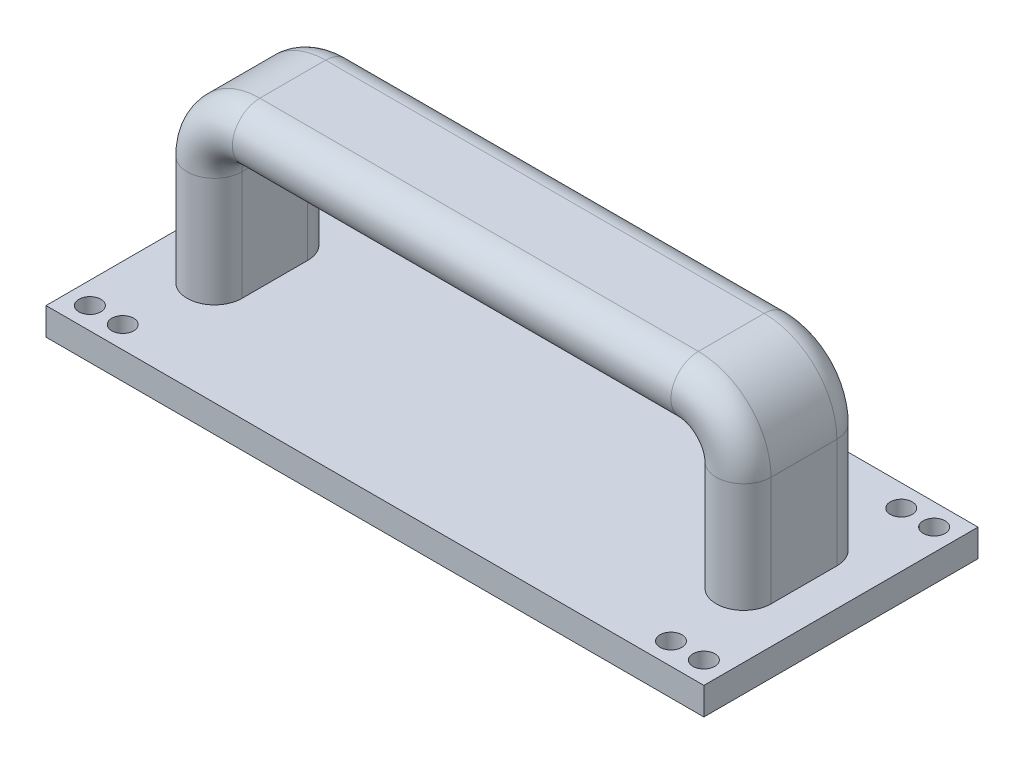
from build123d import *

# Parameters (mm, degrees)
SKETCH3_W           = 120
SKETCH3_H           = 50
BOSS_EXTRUDE1_DEPTH = 5
SKETCH6_R           = 2
CUT_EXTRUDE1_DEPTH  = 5


with BuildPart() as part:
    # Sketch3 → Boss-Extrude1 (new body)
    with BuildSketch(Plane(origin=(0, 0, 0), x_dir=(1, 0, 0), z_dir=(0, 1, 0))):
        Rectangle(SKETCH3_W, SKETCH3_H)
    extrude(amount=BOSS_EXTRUDE1_DEPTH)

    # Sweep1: sweep along a path in Sketch4
    with BuildLine(Plane.XY) as sweep1_path:
        Line((-50, 5), (-50, 25))
        ThreePointArc((-50, 25), (-47.071067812, 32.071067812), (-40, 35))
        Line((-40, 35), (40, 35))
        ThreePointArc((40, 35), (47.071067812, 32.071067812), (50, 25))
        Line((50, 25), (50, 5))
    # Sketch5 → Sweep1 (sweep)
    with BuildSketch(Plane(origin=(0, 5, 0), x_dir=(1, 0, 0), z_dir=(0, 1, 0))):
        with BuildLine():
            Line((-43.257688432, 6), (-43.257688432, -6))
            ThreePointArc((-43.257688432, -6), (-48.257688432, -11), (-53.257688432, -6))
            Line((-53.257688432, -6), (-53.257688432, 6))
            ThreePointArc((-53.257688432, 6), (-48.257688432, 11), (-43.257688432, 6))
        make_face()
    sweep(path=sweep1_path.line)

    # Sketch6 → Cut-Extrude1 (cut)
    with BuildSketch(Plane(origin=(0, 5, 0), x_dir=(1, 0, 0), z_dir=(0, 1, 0))):
        with Locations(Location((-56, 21, 0), (0, 0, 270))):
            Circle(SKETCH6_R)
        with Locations(Location((-50, 21, 0), (0, 0, 270))):
            Circle(SKETCH6_R)
        with Locations(Location((-50, -21, 0), (0, 0, 90))):
            Circle(SKETCH6_R)
        with Locations(Location((-56, -21, 0), (0, 0, 90))):
            Circle(SKETCH6_R)
        with Locations(Location((56, -21, 0), (0, 0, 270))):
            Circle(SKETCH6_R)
        with Locations(Location((50, -21, 0), (0, 0, 270))):
            Circle(SKETCH6_R)
        with Locations(Location((50, 21, 0), (0, 0, 90))):
            Circle(SKETCH6_R)
        with Locations(Location((56, 21, 0), (0, 0, 90))):
            Circle(SKETCH6_R)
    extrude(amount=-CUT_EXTRUDE1_DEPTH, mode=Mode.SUBTRACT)


solid = part.part
